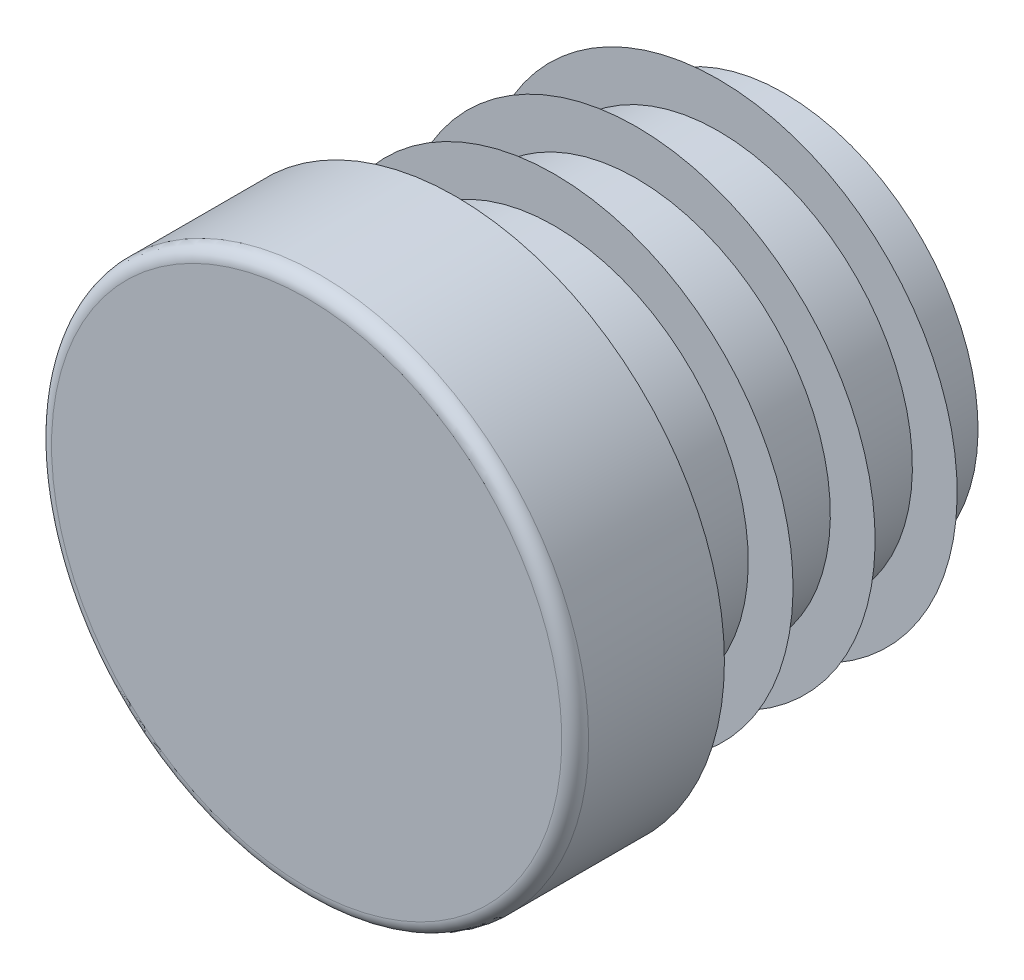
ISO-10303-21;
HEADER;
FILE_DESCRIPTION(('STEP AP214'),'2;1');
FILE_NAME('part.step','',(''),(''),'','','');
FILE_SCHEMA(('AUTOMOTIVE_DESIGN { 1 0 10303 214 1 1 1 1 }'));
ENDSEC;
DATA;
#1=APPLICATION_CONTEXT('core data for automotive mechanical design processes');
#2=APPLICATION_PROTOCOL_DEFINITION('international standard','automotive_design',2000,#1);
#3=PRODUCT_CONTEXT('',#1,'mechanical');
#4=PRODUCT('Part','Part','',(#3));
#5=PRODUCT_RELATED_PRODUCT_CATEGORY('part','',(#4));
#6=PRODUCT_DEFINITION_FORMATION('','',#4);
#7=PRODUCT_DEFINITION_CONTEXT('part definition',#1,'design');
#8=PRODUCT_DEFINITION('design','',#6,#7);
#9=PRODUCT_DEFINITION_SHAPE('','',#8);
#10=(LENGTH_UNIT() NAMED_UNIT(*) SI_UNIT(.MILLI.,.METRE.));
#11=(NAMED_UNIT(*) PLANE_ANGLE_UNIT() SI_UNIT($,.RADIAN.));
#12=(NAMED_UNIT(*) SI_UNIT($,.STERADIAN.) SOLID_ANGLE_UNIT());
#13=UNCERTAINTY_MEASURE_WITH_UNIT(LENGTH_MEASURE(1.E-05),#10,'distance_accuracy_value','');
#14=(GEOMETRIC_REPRESENTATION_CONTEXT(3) GLOBAL_UNCERTAINTY_ASSIGNED_CONTEXT((#13)) GLOBAL_UNIT_ASSIGNED_CONTEXT((#10,
#11,#12)) REPRESENTATION_CONTEXT('',''));
#15=CARTESIAN_POINT('',(0.,0.,0.));
#16=DIRECTION('',(0.,0.,1.));
#17=DIRECTION('',(1.,0.,0.));
#18=AXIS2_PLACEMENT_3D('',#15,#16,#17);
#19=CARTESIAN_POINT('',(0.,0.,5.));
#20=DIRECTION('',(0.,0.,-1.));
#21=DIRECTION('',(0.,1.,0.));
#22=AXIS2_PLACEMENT_3D('',#19,#20,#21);
#23=PLANE('',#22);
#24=CARTESIAN_POINT('',(0.,0.,5.));
#25=DIRECTION('',(0.,0.,-1.));
#26=DIRECTION('',(0.,1.,0.));
#27=AXIS2_PLACEMENT_3D('',#24,#25,#26);
#28=CIRCLE('',#27,8.55);
#29=CARTESIAN_POINT('',(0.,8.55,5.));
#30=VERTEX_POINT('',#29);
#31=EDGE_CURVE('E8',#30,#30,#28,.T.);
#32=ORIENTED_EDGE('',*,*,#31,.F.);
#33=EDGE_LOOP('',(#32));
#34=FACE_BOUND('',#33,.T.);
#35=ADVANCED_FACE('F12',(#34),#23,.F.);
#36=CARTESIAN_POINT('',(0.,0.,4.55));
#37=DIRECTION('',(0.,0.,-1.));
#38=DIRECTION('',(0.,1.,0.));
#39=AXIS2_PLACEMENT_3D('',#36,#37,#38);
#40=TOROIDAL_SURFACE('',#39,8.55,0.45);
#41=ORIENTED_EDGE('',*,*,#31,.T.);
#42=EDGE_LOOP('',(#41));
#43=FACE_BOUND('',#42,.T.);
#44=CARTESIAN_POINT('',(0.,0.,4.55));
#45=DIRECTION('',(0.,0.,-1.));
#46=DIRECTION('',(0.,1.,0.));
#47=AXIS2_PLACEMENT_3D('',#44,#45,#46);
#48=CIRCLE('',#47,9.);
#49=CARTESIAN_POINT('',(0.,9.,4.55));
#50=VERTEX_POINT('',#49);
#51=EDGE_CURVE('E18',#50,#50,#48,.T.);
#52=ORIENTED_EDGE('',*,*,#51,.F.);
#53=EDGE_LOOP('',(#52));
#54=FACE_BOUND('',#53,.T.);
#55=ADVANCED_FACE('F159',(#43,#54),#40,.T.);
#56=CARTESIAN_POINT('',(0.,0.,-11.));
#57=DIRECTION('',(0.,0.,-1.));
#58=DIRECTION('',(0.,1.,0.));
#59=AXIS2_PLACEMENT_3D('',#56,#57,#58);
#60=CYLINDRICAL_SURFACE('',#59,9.);
#61=CARTESIAN_POINT('',(0.,0.,0.));
#62=DIRECTION('',(0.,0.,-1.));
#63=DIRECTION('',(0.,1.,0.));
#64=AXIS2_PLACEMENT_3D('',#61,#62,#63);
#65=CIRCLE('',#64,9.);
#66=CARTESIAN_POINT('',(0.,9.,0.));
#67=VERTEX_POINT('',#66);
#68=EDGE_CURVE('E22',#67,#67,#65,.T.);
#69=ORIENTED_EDGE('',*,*,#68,.F.);
#70=EDGE_LOOP('',(#69));
#71=FACE_BOUND('',#70,.T.);
#72=ORIENTED_EDGE('',*,*,#51,.T.);
#73=EDGE_LOOP('',(#72));
#74=FACE_BOUND('',#73,.T.);
#75=ADVANCED_FACE('F154',(#71,#74),#60,.T.);
#76=CARTESIAN_POINT('',(9.,0.,0.));
#77=DIRECTION('',(0.,0.,1.));
#78=DIRECTION('',(0.,-1.,0.));
#79=AXIS2_PLACEMENT_3D('',#76,#77,#78);
#80=PLANE('',#79);
#81=CARTESIAN_POINT('',(0.,0.,0.));
#82=DIRECTION('',(0.,0.,-1.));
#83=DIRECTION('',(0.,1.,0.));
#84=AXIS2_PLACEMENT_3D('',#81,#82,#83);
#85=CIRCLE('',#84,6.5);
#86=CARTESIAN_POINT('',(0.,6.5,0.));
#87=VERTEX_POINT('',#86);
#88=EDGE_CURVE('E26',#87,#87,#85,.T.);
#89=ORIENTED_EDGE('',*,*,#88,.F.);
#90=EDGE_LOOP('',(#89));
#91=FACE_BOUND('',#90,.T.);
#92=ORIENTED_EDGE('',*,*,#68,.T.);
#93=EDGE_LOOP('',(#92));
#94=FACE_BOUND('',#93,.T.);
#95=ADVANCED_FACE('F148',(#91,#94),#80,.F.);
#96=CARTESIAN_POINT('',(0.,0.,-11.));
#97=DIRECTION('',(0.,0.,-1.));
#98=DIRECTION('',(0.,1.,0.));
#99=AXIS2_PLACEMENT_3D('',#96,#97,#98);
#100=CYLINDRICAL_SURFACE('',#99,6.5);
#101=CARTESIAN_POINT('',(0.,0.,-0.55));
#102=DIRECTION('',(0.,0.,-1.));
#103=DIRECTION('',(0.,1.,0.));
#104=AXIS2_PLACEMENT_3D('',#101,#102,#103);
#105=CIRCLE('',#104,6.5);
#106=CARTESIAN_POINT('',(0.,6.5,-0.55));
#107=VERTEX_POINT('',#106);
#108=EDGE_CURVE('E31',#107,#107,#105,.T.);
#109=ORIENTED_EDGE('',*,*,#108,.F.);
#110=EDGE_LOOP('',(#109));
#111=FACE_BOUND('',#110,.T.);
#112=ORIENTED_EDGE('',*,*,#88,.T.);
#113=EDGE_LOOP('',(#112));
#114=FACE_BOUND('',#113,.T.);
#115=ADVANCED_FACE('F142',(#111,#114),#100,.T.);
#116=CARTESIAN_POINT('',(6.5,0.,-0.55));
#117=DIRECTION('',(0.,0.,-1.));
#118=DIRECTION('',(0.,1.,0.));
#119=AXIS2_PLACEMENT_3D('',#116,#117,#118);
#120=PLANE('',#119);
#121=CARTESIAN_POINT('',(0.,0.,-0.55));
#122=DIRECTION('',(0.,0.,-1.));
#123=DIRECTION('',(0.,1.,0.));
#124=AXIS2_PLACEMENT_3D('',#121,#122,#123);
#125=CIRCLE('',#124,8.);
#126=CARTESIAN_POINT('',(0.,8.,-0.55));
#127=VERTEX_POINT('',#126);
#128=EDGE_CURVE('E34',#127,#127,#125,.T.);
#129=ORIENTED_EDGE('',*,*,#128,.F.);
#130=EDGE_LOOP('',(#129));
#131=FACE_BOUND('',#130,.T.);
#132=ORIENTED_EDGE('',*,*,#108,.T.);
#133=EDGE_LOOP('',(#132));
#134=FACE_BOUND('',#133,.T.);
#135=ADVANCED_FACE('F136',(#131,#134),#120,.F.);
#136=CARTESIAN_POINT('',(0.,0.,-0.55));
#137=DIRECTION('',(0.,0.,1.));
#138=DIRECTION('',(0.,-1.,0.));
#139=AXIS2_PLACEMENT_3D('',#136,#137,#138);
#140=CONICAL_SURFACE('',#139,8.,0.959931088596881);
#141=CARTESIAN_POINT('',(0.,0.,-1.60031130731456));
#142=DIRECTION('',(0.,0.,-1.));
#143=DIRECTION('',(0.,1.,0.));
#144=AXIS2_PLACEMENT_3D('',#141,#142,#143);
#145=CIRCLE('',#144,6.5);
#146=CARTESIAN_POINT('',(0.,6.5,-1.60031130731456));
#147=VERTEX_POINT('',#146);
#148=EDGE_CURVE('E37',#147,#147,#145,.T.);
#149=ORIENTED_EDGE('',*,*,#148,.F.);
#150=EDGE_LOOP('',(#149));
#151=FACE_BOUND('',#150,.T.);
#152=ORIENTED_EDGE('',*,*,#128,.T.);
#153=EDGE_LOOP('',(#152));
#154=FACE_BOUND('',#153,.T.);
#155=ADVANCED_FACE('F130',(#151,#154),#140,.T.);
#156=CARTESIAN_POINT('',(0.,0.,-11.));
#157=DIRECTION('',(0.,0.,-1.));
#158=DIRECTION('',(0.,1.,0.));
#159=AXIS2_PLACEMENT_3D('',#156,#157,#158);
#160=CYLINDRICAL_SURFACE('',#159,6.5);
#161=CARTESIAN_POINT('',(0.,0.,-3.3));
#162=DIRECTION('',(0.,0.,-1.));
#163=DIRECTION('',(0.,1.,0.));
#164=AXIS2_PLACEMENT_3D('',#161,#162,#163);
#165=CIRCLE('',#164,6.5);
#166=CARTESIAN_POINT('',(0.,6.5,-3.3));
#167=VERTEX_POINT('',#166);
#168=EDGE_CURVE('E40',#167,#167,#165,.T.);
#169=ORIENTED_EDGE('',*,*,#168,.F.);
#170=EDGE_LOOP('',(#169));
#171=FACE_BOUND('',#170,.T.);
#172=ORIENTED_EDGE('',*,*,#148,.T.);
#173=EDGE_LOOP('',(#172));
#174=FACE_BOUND('',#173,.T.);
#175=ADVANCED_FACE('F124',(#171,#174),#160,.T.);
#176=CARTESIAN_POINT('',(6.5,0.,-3.3));
#177=DIRECTION('',(0.,0.,-1.));
#178=DIRECTION('',(0.,1.,0.));
#179=AXIS2_PLACEMENT_3D('',#176,#177,#178);
#180=PLANE('',#179);
#181=CARTESIAN_POINT('',(0.,0.,-3.3));
#182=DIRECTION('',(0.,0.,-1.));
#183=DIRECTION('',(0.,1.,0.));
#184=AXIS2_PLACEMENT_3D('',#181,#182,#183);
#185=CIRCLE('',#184,8.);
#186=CARTESIAN_POINT('',(0.,8.,-3.3));
#187=VERTEX_POINT('',#186);
#188=EDGE_CURVE('E43',#187,#187,#185,.T.);
#189=ORIENTED_EDGE('',*,*,#188,.F.);
#190=EDGE_LOOP('',(#189));
#191=FACE_BOUND('',#190,.T.);
#192=ORIENTED_EDGE('',*,*,#168,.T.);
#193=EDGE_LOOP('',(#192));
#194=FACE_BOUND('',#193,.T.);
#195=ADVANCED_FACE('F118',(#191,#194),#180,.F.);
#196=CARTESIAN_POINT('',(0.,0.,-3.3));
#197=DIRECTION('',(0.,0.,1.));
#198=DIRECTION('',(0.,-1.,0.));
#199=AXIS2_PLACEMENT_3D('',#196,#197,#198);
#200=CONICAL_SURFACE('',#199,8.,0.959931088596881);
#201=CARTESIAN_POINT('',(0.,0.,-4.35031130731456));
#202=DIRECTION('',(0.,0.,-1.));
#203=DIRECTION('',(0.,1.,0.));
#204=AXIS2_PLACEMENT_3D('',#201,#202,#203);
#205=CIRCLE('',#204,6.5);
#206=CARTESIAN_POINT('',(0.,6.5,-4.35031130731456));
#207=VERTEX_POINT('',#206);
#208=EDGE_CURVE('E46',#207,#207,#205,.T.);
#209=ORIENTED_EDGE('',*,*,#208,.F.);
#210=EDGE_LOOP('',(#209));
#211=FACE_BOUND('',#210,.T.);
#212=ORIENTED_EDGE('',*,*,#188,.T.);
#213=EDGE_LOOP('',(#212));
#214=FACE_BOUND('',#213,.T.);
#215=ADVANCED_FACE('F112',(#211,#214),#200,.T.);
#216=CARTESIAN_POINT('',(0.,0.,-11.));
#217=DIRECTION('',(0.,0.,-1.));
#218=DIRECTION('',(0.,1.,0.));
#219=AXIS2_PLACEMENT_3D('',#216,#217,#218);
#220=CYLINDRICAL_SURFACE('',#219,6.5);
#221=CARTESIAN_POINT('',(0.,0.,-6.05));
#222=DIRECTION('',(0.,0.,-1.));
#223=DIRECTION('',(0.,1.,0.));
#224=AXIS2_PLACEMENT_3D('',#221,#222,#223);
#225=CIRCLE('',#224,6.5);
#226=CARTESIAN_POINT('',(0.,6.5,-6.05));
#227=VERTEX_POINT('',#226);
#228=EDGE_CURVE('E49',#227,#227,#225,.T.);
#229=ORIENTED_EDGE('',*,*,#228,.F.);
#230=EDGE_LOOP('',(#229));
#231=FACE_BOUND('',#230,.T.);
#232=ORIENTED_EDGE('',*,*,#208,.T.);
#233=EDGE_LOOP('',(#232));
#234=FACE_BOUND('',#233,.T.);
#235=ADVANCED_FACE('F106',(#231,#234),#220,.T.);
#236=CARTESIAN_POINT('',(6.5,0.,-6.05));
#237=DIRECTION('',(0.,0.,-1.));
#238=DIRECTION('',(0.,1.,0.));
#239=AXIS2_PLACEMENT_3D('',#236,#237,#238);
#240=PLANE('',#239);
#241=CARTESIAN_POINT('',(0.,0.,-6.05));
#242=DIRECTION('',(0.,0.,-1.));
#243=DIRECTION('',(0.,1.,0.));
#244=AXIS2_PLACEMENT_3D('',#241,#242,#243);
#245=CIRCLE('',#244,8.);
#246=CARTESIAN_POINT('',(0.,8.,-6.05));
#247=VERTEX_POINT('',#246);
#248=EDGE_CURVE('E52',#247,#247,#245,.T.);
#249=ORIENTED_EDGE('',*,*,#248,.F.);
#250=EDGE_LOOP('',(#249));
#251=FACE_BOUND('',#250,.T.);
#252=ORIENTED_EDGE('',*,*,#228,.T.);
#253=EDGE_LOOP('',(#252));
#254=FACE_BOUND('',#253,.T.);
#255=ADVANCED_FACE('F100',(#251,#254),#240,.F.);
#256=CARTESIAN_POINT('',(0.,0.,-6.05));
#257=DIRECTION('',(0.,0.,1.));
#258=DIRECTION('',(0.,-1.,0.));
#259=AXIS2_PLACEMENT_3D('',#256,#257,#258);
#260=CONICAL_SURFACE('',#259,8.,0.959931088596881);
#261=CARTESIAN_POINT('',(0.,0.,-7.10031130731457));
#262=DIRECTION('',(0.,0.,-1.));
#263=DIRECTION('',(0.,1.,0.));
#264=AXIS2_PLACEMENT_3D('',#261,#262,#263);
#265=CIRCLE('',#264,6.5);
#266=CARTESIAN_POINT('',(0.,6.5,-7.10031130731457));
#267=VERTEX_POINT('',#266);
#268=EDGE_CURVE('E55',#267,#267,#265,.T.);
#269=ORIENTED_EDGE('',*,*,#268,.F.);
#270=EDGE_LOOP('',(#269));
#271=FACE_BOUND('',#270,.T.);
#272=ORIENTED_EDGE('',*,*,#248,.T.);
#273=EDGE_LOOP('',(#272));
#274=FACE_BOUND('',#273,.T.);
#275=ADVANCED_FACE('F94',(#271,#274),#260,.T.);
#276=CARTESIAN_POINT('',(0.,0.,-11.));
#277=DIRECTION('',(0.,0.,-1.));
#278=DIRECTION('',(0.,1.,0.));
#279=AXIS2_PLACEMENT_3D('',#276,#277,#278);
#280=CYLINDRICAL_SURFACE('',#279,6.5);
#281=CARTESIAN_POINT('',(0.,0.,-8.8));
#282=DIRECTION('',(0.,0.,-1.));
#283=DIRECTION('',(0.,1.,0.));
#284=AXIS2_PLACEMENT_3D('',#281,#282,#283);
#285=CIRCLE('',#284,6.5);
#286=CARTESIAN_POINT('',(0.,6.5,-8.8));
#287=VERTEX_POINT('',#286);
#288=EDGE_CURVE('E58',#287,#287,#285,.T.);
#289=ORIENTED_EDGE('',*,*,#288,.F.);
#290=EDGE_LOOP('',(#289));
#291=FACE_BOUND('',#290,.T.);
#292=ORIENTED_EDGE('',*,*,#268,.T.);
#293=EDGE_LOOP('',(#292));
#294=FACE_BOUND('',#293,.T.);
#295=ADVANCED_FACE('F88',(#291,#294),#280,.T.);
#296=CARTESIAN_POINT('',(6.5,0.,-8.8));
#297=DIRECTION('',(0.,0.,-1.));
#298=DIRECTION('',(0.,1.,0.));
#299=AXIS2_PLACEMENT_3D('',#296,#297,#298);
#300=PLANE('',#299);
#301=CARTESIAN_POINT('',(0.,0.,-8.8));
#302=DIRECTION('',(0.,0.,-1.));
#303=DIRECTION('',(0.,1.,0.));
#304=AXIS2_PLACEMENT_3D('',#301,#302,#303);
#305=CIRCLE('',#304,8.);
#306=CARTESIAN_POINT('',(0.,8.,-8.8));
#307=VERTEX_POINT('',#306);
#308=EDGE_CURVE('E61',#307,#307,#305,.T.);
#309=ORIENTED_EDGE('',*,*,#308,.F.);
#310=EDGE_LOOP('',(#309));
#311=FACE_BOUND('',#310,.T.);
#312=ORIENTED_EDGE('',*,*,#288,.T.);
#313=EDGE_LOOP('',(#312));
#314=FACE_BOUND('',#313,.T.);
#315=ADVANCED_FACE('F82',(#311,#314),#300,.F.);
#316=CARTESIAN_POINT('',(0.,0.,-8.8));
#317=DIRECTION('',(0.,0.,1.));
#318=DIRECTION('',(0.,-1.,0.));
#319=AXIS2_PLACEMENT_3D('',#316,#317,#318);
#320=CONICAL_SURFACE('',#319,8.,0.95993108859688);
#321=CARTESIAN_POINT('',(0.,0.,-9.85031130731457));
#322=DIRECTION('',(0.,0.,-1.));
#323=DIRECTION('',(0.,1.,0.));
#324=AXIS2_PLACEMENT_3D('',#321,#322,#323);
#325=CIRCLE('',#324,6.5);
#326=CARTESIAN_POINT('',(0.,6.5,-9.85031130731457));
#327=VERTEX_POINT('',#326);
#328=EDGE_CURVE('E64',#327,#327,#325,.T.);
#329=ORIENTED_EDGE('',*,*,#328,.F.);
#330=EDGE_LOOP('',(#329));
#331=FACE_BOUND('',#330,.T.);
#332=ORIENTED_EDGE('',*,*,#308,.T.);
#333=EDGE_LOOP('',(#332));
#334=FACE_BOUND('',#333,.T.);
#335=ADVANCED_FACE('F76',(#331,#334),#320,.T.);
#336=CARTESIAN_POINT('',(0.,0.,-11.));
#337=DIRECTION('',(0.,0.,-1.));
#338=DIRECTION('',(0.,1.,0.));
#339=AXIS2_PLACEMENT_3D('',#336,#337,#338);
#340=CYLINDRICAL_SURFACE('',#339,6.5);
#341=CARTESIAN_POINT('',(0.,0.,-11.));
#342=DIRECTION('',(0.,0.,-1.));
#343=DIRECTION('',(0.,1.,0.));
#344=AXIS2_PLACEMENT_3D('',#341,#342,#343);
#345=CIRCLE('',#344,6.5);
#346=CARTESIAN_POINT('',(0.,6.5,-11.));
#347=VERTEX_POINT('',#346);
#348=EDGE_CURVE('E67',#347,#347,#345,.T.);
#349=ORIENTED_EDGE('',*,*,#348,.F.);
#350=EDGE_LOOP('',(#349));
#351=FACE_BOUND('',#350,.T.);
#352=ORIENTED_EDGE('',*,*,#328,.T.);
#353=EDGE_LOOP('',(#352));
#354=FACE_BOUND('',#353,.T.);
#355=ADVANCED_FACE('F73',(#351,#354),#340,.T.);
#356=CARTESIAN_POINT('',(6.5,0.,-11.));
#357=DIRECTION('',(0.,0.,1.));
#358=DIRECTION('',(0.,-1.,0.));
#359=AXIS2_PLACEMENT_3D('',#356,#357,#358);
#360=PLANE('',#359);
#361=ORIENTED_EDGE('',*,*,#348,.T.);
#362=EDGE_LOOP('',(#361));
#363=FACE_BOUND('',#362,.T.);
#364=ADVANCED_FACE('F71',(#363),#360,.F.);
#365=CLOSED_SHELL('',(#35,#55,#75,#95,#115,#135,#155,#175,#195,#215,#235,#255,#275,#295,#315,
#335,#355,#364));
#366=MANIFOLD_SOLID_BREP('B1',#365);
#367=ADVANCED_BREP_SHAPE_REPRESENTATION('',(#18,#366),#14);
#368=SHAPE_DEFINITION_REPRESENTATION(#9,#367);
ENDSEC;
END-ISO-10303-21;
